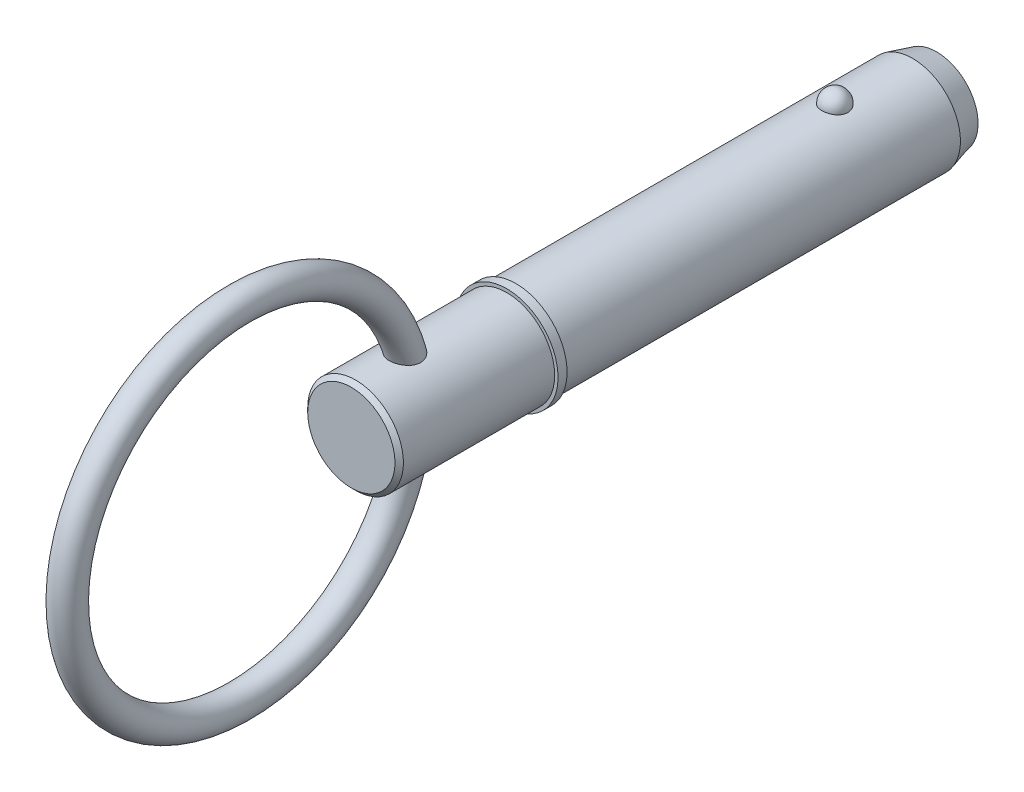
ISO-10303-21;
HEADER;
FILE_DESCRIPTION(('STEP AP214'),'2;1');
FILE_NAME('part.step','',(''),(''),'','','');
FILE_SCHEMA(('AUTOMOTIVE_DESIGN { 1 0 10303 214 1 1 1 1 }'));
ENDSEC;
DATA;
#1=APPLICATION_CONTEXT('core data for automotive mechanical design processes');
#2=APPLICATION_PROTOCOL_DEFINITION('international standard','automotive_design',2000,#1);
#3=PRODUCT_CONTEXT('',#1,'mechanical');
#4=PRODUCT('Part','Part','',(#3));
#5=PRODUCT_RELATED_PRODUCT_CATEGORY('part','',(#4));
#6=PRODUCT_DEFINITION_FORMATION('','',#4);
#7=PRODUCT_DEFINITION_CONTEXT('part definition',#1,'design');
#8=PRODUCT_DEFINITION('design','',#6,#7);
#9=PRODUCT_DEFINITION_SHAPE('','',#8);
#10=(LENGTH_UNIT() NAMED_UNIT(*) SI_UNIT(.MILLI.,.METRE.));
#11=(NAMED_UNIT(*) PLANE_ANGLE_UNIT() SI_UNIT($,.RADIAN.));
#12=(NAMED_UNIT(*) SI_UNIT($,.STERADIAN.) SOLID_ANGLE_UNIT());
#13=UNCERTAINTY_MEASURE_WITH_UNIT(LENGTH_MEASURE(1.E-05),#10,'distance_accuracy_value','');
#14=(GEOMETRIC_REPRESENTATION_CONTEXT(3) GLOBAL_UNCERTAINTY_ASSIGNED_CONTEXT((#13)) GLOBAL_UNIT_ASSIGNED_CONTEXT((#10,
#11,#12)) REPRESENTATION_CONTEXT('',''));
#15=CARTESIAN_POINT('',(0.,0.,0.));
#16=DIRECTION('',(0.,0.,1.));
#17=DIRECTION('',(1.,0.,0.));
#18=AXIS2_PLACEMENT_3D('',#15,#16,#17);
#19=CARTESIAN_POINT('',(0.,0.,50.8));
#20=DIRECTION('',(0.,0.,-1.));
#21=DIRECTION('',(-1.,0.,0.));
#22=AXIS2_PLACEMENT_3D('',#19,#20,#21);
#23=CYLINDRICAL_SURFACE('',#22,7.94);
#24=CARTESIAN_POINT('',(2.13020349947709,7.64891057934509,-2.15));
#25=CARTESIAN_POINT('',(2.1302012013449,7.64891247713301,-2.02978166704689));
#26=CARTESIAN_POINT('',(2.12037546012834,7.65166842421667,-1.90953383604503));
#27=CARTESIAN_POINT('',(2.08130792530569,7.66238579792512,-1.67243962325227));
#28=CARTESIAN_POINT('',(2.05205785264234,7.67034944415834,-1.55559471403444));
#29=CARTESIAN_POINT('',(1.97489181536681,7.69057749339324,-1.32869361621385));
#30=CARTESIAN_POINT('',(1.92698409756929,7.70283999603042,-1.21863445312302));
#31=CARTESIAN_POINT('',(1.81370645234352,7.73029430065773,-1.00831338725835));
#32=CARTESIAN_POINT('',(1.74833715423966,7.7454859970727,-0.908051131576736));
#33=CARTESIAN_POINT('',(1.60144242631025,7.77718699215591,-0.719628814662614));
#34=CARTESIAN_POINT('',(1.51984382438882,7.7937020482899,-0.631526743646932));
#35=CARTESIAN_POINT('',(1.34279837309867,7.82614685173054,-0.470411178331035));
#36=CARTESIAN_POINT('',(1.24735148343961,7.84207659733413,-0.397397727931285));
#37=CARTESIAN_POINT('',(1.04544839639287,7.87153116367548,-0.26868118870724));
#38=CARTESIAN_POINT('',(0.939022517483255,7.88506234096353,-0.212932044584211));
#39=CARTESIAN_POINT('',(0.717931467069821,7.90825597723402,-0.120080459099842));
#40=CARTESIAN_POINT('',(0.603267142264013,7.9179188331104,-0.0829761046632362));
#41=CARTESIAN_POINT('',(0.371015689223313,7.93216561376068,-0.0289596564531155));
#42=CARTESIAN_POINT('',(0.253510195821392,7.93683225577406,-0.0117183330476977));
#43=CARTESIAN_POINT('',(0.0171784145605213,7.94086051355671,0.0031892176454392));
#44=CARTESIAN_POINT('',(-0.101647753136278,7.94022260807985,0.00085721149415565));
#45=CARTESIAN_POINT('',(-0.335567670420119,7.93375751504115,-0.023146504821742));
#46=CARTESIAN_POINT('',(-0.450690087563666,7.92799987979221,-0.0445590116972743));
#47=CARTESIAN_POINT('',(-0.675610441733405,7.91200792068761,-0.105760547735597));
#48=CARTESIAN_POINT('',(-0.785408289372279,7.90177352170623,-0.145549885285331));
#49=CARTESIAN_POINT('',(-0.9972706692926,7.87784802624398,-0.242675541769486));
#50=CARTESIAN_POINT('',(-1.0992893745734,7.86413823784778,-0.300107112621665));
#51=CARTESIAN_POINT('',(-1.29223659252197,7.83474718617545,-0.430887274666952));
#52=CARTESIAN_POINT('',(-1.38316404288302,7.81906573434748,-0.504237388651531));
#53=CARTESIAN_POINT('',(-1.55313516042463,7.78710451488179,-0.666358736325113));
#54=CARTESIAN_POINT('',(-1.63193689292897,7.77081906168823,-0.75538257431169));
#55=CARTESIAN_POINT('',(-1.77366356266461,7.73970270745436,-0.945507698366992));
#56=CARTESIAN_POINT('',(-1.83658745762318,7.72487190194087,-1.04660977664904));
#57=CARTESIAN_POINT('',(-1.94556640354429,7.6981535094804,-1.25927689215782));
#58=CARTESIAN_POINT('',(-1.99143480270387,7.6862989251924,-1.3709418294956));
#59=CARTESIAN_POINT('',(-2.06418311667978,7.66708387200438,-1.60066153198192));
#60=CARTESIAN_POINT('',(-2.0910635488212,7.65972328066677,-1.71871612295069));
#61=CARTESIAN_POINT('',(-2.12508507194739,7.65035479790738,-1.9573607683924));
#62=CARTESIAN_POINT('',(-2.13230490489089,7.64832555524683,-2.0779387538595));
#63=CARTESIAN_POINT('',(-2.12704767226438,7.64978921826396,-2.31862835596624));
#64=CARTESIAN_POINT('',(-2.1145710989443,7.6532819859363,-2.43873998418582));
#65=CARTESIAN_POINT('',(-2.07034166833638,7.66536368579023,-2.67451689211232));
#66=CARTESIAN_POINT('',(-2.03867758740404,7.67392914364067,-2.79020005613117));
#67=CARTESIAN_POINT('',(-1.95694065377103,7.69517736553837,-3.01446692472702));
#68=CARTESIAN_POINT('',(-1.90686710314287,7.70786028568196,-3.12305035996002));
#69=CARTESIAN_POINT('',(-1.78925555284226,7.73600831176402,-3.3306597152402));
#70=CARTESIAN_POINT('',(-1.72162904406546,7.75148739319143,-3.4296336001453));
#71=CARTESIAN_POINT('',(-1.57074739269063,7.78346215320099,-3.61466914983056));
#72=CARTESIAN_POINT('',(-1.48749169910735,7.79995786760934,-3.70073035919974));
#73=CARTESIAN_POINT('',(-1.30720250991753,7.83219119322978,-3.85783594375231));
#74=CARTESIAN_POINT('',(-1.2101234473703,7.84792605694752,-3.92882863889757));
#75=CARTESIAN_POINT('',(-1.00503150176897,7.87681523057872,-4.05342383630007));
#76=CARTESIAN_POINT('',(-0.897019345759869,7.88996971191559,-4.10702749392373));
#77=CARTESIAN_POINT('',(-0.674439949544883,7.91208451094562,-4.19477736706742));
#78=CARTESIAN_POINT('',(-0.55996501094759,7.92109245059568,-4.22914554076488));
#79=CARTESIAN_POINT('',(-0.326625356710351,7.93413878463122,-4.27838865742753));
#80=CARTESIAN_POINT('',(-0.20776113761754,7.93817773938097,-4.29326579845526));
#81=CARTESIAN_POINT('',(0.0287357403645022,7.94081322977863,-4.3030062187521));
#82=CARTESIAN_POINT('',(0.14635312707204,7.93950453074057,-4.29821797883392));
#83=CARTESIAN_POINT('',(0.379062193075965,7.93180098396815,-4.26955229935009));
#84=CARTESIAN_POINT('',(0.494153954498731,7.92540630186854,-4.24567548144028));
#85=CARTESIAN_POINT('',(0.718185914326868,7.90824874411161,-4.17962260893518));
#86=CARTESIAN_POINT('',(0.827145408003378,7.89750055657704,-4.13750805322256));
#87=CARTESIAN_POINT('',(1.03638036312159,7.87277755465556,-4.03615078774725));
#88=CARTESIAN_POINT('',(1.13665531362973,7.85880255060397,-3.97690707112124));
#89=CARTESIAN_POINT('',(1.32729731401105,7.82887859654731,-3.84189297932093));
#90=CARTESIAN_POINT('',(1.41749828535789,7.81290379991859,-3.76589388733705));
#91=CARTESIAN_POINT('',(1.58397257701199,7.78086330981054,-3.59992466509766));
#92=CARTESIAN_POINT('',(1.66024342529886,7.76479760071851,-3.50995206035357));
#93=CARTESIAN_POINT('',(1.79805631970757,7.73405928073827,-3.31688321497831));
#94=CARTESIAN_POINT('',(1.85933944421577,7.719413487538,-3.213597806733));
#95=CARTESIAN_POINT('',(1.96397499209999,7.69345992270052,-2.99796163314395));
#96=CARTESIAN_POINT('',(2.00733488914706,7.68215076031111,-2.88561466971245));
#97=CARTESIAN_POINT('',(2.07068045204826,7.66529896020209,-2.6699413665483));
#98=CARTESIAN_POINT('',(2.09296296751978,7.65919990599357,-2.56732606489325));
#99=CARTESIAN_POINT('',(2.12272535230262,7.65100492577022,-2.35981463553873));
#100=CARTESIAN_POINT('',(2.13020550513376,7.64890892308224,-2.25491855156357));
#101=CARTESIAN_POINT('',(2.13020349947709,7.64891057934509,-2.15));
#102=B_SPLINE_CURVE_WITH_KNOTS('',3,(#24,#25,#26,#27,#28,#29,#30,#31,#32,#33,#34,#35,#36,#37,
#38,#39,#40,#41,#42,#43,#44,#45,#46,#47,#48,#49,#50,#51,#52,#53,#54,#55,#56,#57,#58,#59,#60,#61,
#62,#63,#64,#65,#66,#67,#68,#69,#70,#71,#72,#73,#74,#75,#76,#77,#78,#79,#80,#81,#82,#83,#84,#85,
#86,#87,#88,#89,#90,#91,#92,#93,#94,#95,#96,#97,#98,#99,#100,#101),.UNSPECIFIED.,.T.,.F.,(4,2,2,
2,2,2,2,2,2,2,2,2,2,2,2,2,2,2,2,2,2,2,2,2,2,2,2,2,2,2,2,2,2,2,2,2,2,2,4),(0.,0.360277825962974,
0.720709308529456,1.0809816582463,1.44124102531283,1.80316307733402,2.16508618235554,
2.52603531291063,2.88694740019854,3.24178717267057,3.59659491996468,3.94665496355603,
4.29672088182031,4.64871108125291,5.0007349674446,5.3590619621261,5.71741247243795,
6.079576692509,6.44173104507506,6.80243279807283,7.16312553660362,7.52216203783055,
7.88121215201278,8.24210915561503,8.60301888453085,8.96514709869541,9.32725124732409,
9.68508606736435,10.0428805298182,10.3943622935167,10.7458326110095,11.0961268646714,
11.4464417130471,11.8018724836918,12.1573662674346,12.5186252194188,12.8797333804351,
13.1941658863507,13.5085923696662),.UNSPECIFIED.);
#103=CARTESIAN_POINT('',(2.13020349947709,7.64891057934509,-2.15));
#104=VERTEX_POINT('',#103);
#105=EDGE_CURVE('E101',#104,#104,#102,.T.);
#106=ORIENTED_EDGE('',*,*,#105,.T.);
#107=EDGE_LOOP('',(#106));
#108=FACE_BOUND('',#107,.T.);
#109=CARTESIAN_POINT('',(0.,0.,-15.05));
#110=DIRECTION('',(0.,0.,-1.));
#111=DIRECTION('',(-1.,0.,0.));
#112=AXIS2_PLACEMENT_3D('',#109,#110,#111);
#113=CIRCLE('',#112,7.94);
#114=CARTESIAN_POINT('',(-7.94,0.,-15.05));
#115=VERTEX_POINT('',#114);
#116=EDGE_CURVE('E109',#115,#115,#113,.F.);
#117=ORIENTED_EDGE('',*,*,#116,.T.);
#118=EDGE_LOOP('',(#117));
#119=FACE_BOUND('',#118,.T.);
#120=CARTESIAN_POINT('',(0.,0.,50.8));
#121=DIRECTION('',(0.,0.,1.));
#122=DIRECTION('',(1.,0.,0.));
#123=AXIS2_PLACEMENT_3D('',#120,#121,#122);
#124=CIRCLE('',#123,7.94);
#125=CARTESIAN_POINT('',(7.94,0.,50.8));
#126=VERTEX_POINT('',#125);
#127=EDGE_CURVE('E107',#126,#126,#124,.T.);
#128=ORIENTED_EDGE('',*,*,#127,.F.);
#129=EDGE_LOOP('',(#128));
#130=FACE_BOUND('',#129,.T.);
#131=ADVANCED_FACE('F39',(#108,#119,#130),#23,.T.);
#132=CARTESIAN_POINT('',(0.,0.,-19.05));
#133=DIRECTION('',(0.,0.,-1.));
#134=DIRECTION('',(-1.,0.,0.));
#135=AXIS2_PLACEMENT_3D('',#132,#133,#134);
#136=PLANE('',#135);
#137=CARTESIAN_POINT('',(0.,0.,-19.05));
#138=DIRECTION('',(0.,0.,-1.));
#139=DIRECTION('',(-1.,0.,0.));
#140=AXIS2_PLACEMENT_3D('',#137,#138,#139);
#141=CIRCLE('',#140,6.86820323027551);
#142=CARTESIAN_POINT('',(-6.86820323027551,0.,-19.05));
#143=VERTEX_POINT('',#142);
#144=EDGE_CURVE('E142',#143,#143,#141,.T.);
#145=ORIENTED_EDGE('',*,*,#144,.T.);
#146=EDGE_LOOP('',(#145));
#147=FACE_BOUND('',#146,.T.);
#148=ADVANCED_FACE('F87',(#147),#136,.T.);
#149=CARTESIAN_POINT('',(0.,0.,-19.05));
#150=DIRECTION('',(0.,0.,1.));
#151=DIRECTION('',(1.,0.,0.));
#152=AXIS2_PLACEMENT_3D('',#149,#150,#151);
#153=CONICAL_SURFACE('',#152,6.86820323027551,0.261799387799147);
#154=ORIENTED_EDGE('',*,*,#116,.F.);
#155=EDGE_LOOP('',(#154));
#156=FACE_BOUND('',#155,.T.);
#157=ORIENTED_EDGE('',*,*,#144,.F.);
#158=EDGE_LOOP('',(#157));
#159=FACE_BOUND('',#158,.T.);
#160=ADVANCED_FACE('F93',(#156,#159),#153,.T.);
#161=CARTESIAN_POINT('',(0.,7.94,-2.15));
#162=DIRECTION('',(0.,1.,0.));
#163=DIRECTION('',(0.,0.,1.));
#164=AXIS2_PLACEMENT_3D('',#161,#162,#163);
#165=SPHERICAL_SURFACE('',#164,2.15);
#166=ORIENTED_EDGE('',*,*,#105,.F.);
#167=EDGE_LOOP('',(#166));
#168=FACE_BOUND('',#167,.T.);
#169=ADVANCED_FACE('F112',(#168),#165,.T.);
#170=CARTESIAN_POINT('',(0.,0.,50.8));
#171=DIRECTION('',(0.,0.,-1.));
#172=DIRECTION('',(-1.,0.,0.));
#173=AXIS2_PLACEMENT_3D('',#170,#171,#172);
#174=PLANE('',#173);
#175=ORIENTED_EDGE('',*,*,#127,.T.);
#176=EDGE_LOOP('',(#175));
#177=FACE_BOUND('',#176,.T.);
#178=CARTESIAN_POINT('',(0.,0.,50.8));
#179=DIRECTION('',(0.,0.,-1.));
#180=DIRECTION('',(-1.,0.,0.));
#181=AXIS2_PLACEMENT_3D('',#178,#179,#180);
#182=CIRCLE('',#181,8.5);
#183=CARTESIAN_POINT('',(-8.5,0.,50.8));
#184=VERTEX_POINT('',#183);
#185=EDGE_CURVE('E108',#184,#184,#182,.T.);
#186=ORIENTED_EDGE('',*,*,#185,.T.);
#187=EDGE_LOOP('',(#186));
#188=FACE_BOUND('',#187,.T.);
#189=ADVANCED_FACE('F116',(#177,#188),#174,.T.);
#190=CARTESIAN_POINT('',(0.,0.,33.7287874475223));
#191=DIRECTION('',(0.,0.,-1.));
#192=DIRECTION('',(-1.,0.,0.));
#193=AXIS2_PLACEMENT_3D('',#190,#191,#192);
#194=CYLINDRICAL_SURFACE('',#193,8.5);
#195=CARTESIAN_POINT('',(0.,0.,52.3));
#196=DIRECTION('',(0.,0.,-1.));
#197=DIRECTION('',(-1.,0.,0.));
#198=AXIS2_PLACEMENT_3D('',#195,#196,#197);
#199=CIRCLE('',#198,8.5);
#200=CARTESIAN_POINT('',(-8.5,0.,52.3));
#201=VERTEX_POINT('',#200);
#202=EDGE_CURVE('E133',#201,#201,#199,.T.);
#203=ORIENTED_EDGE('',*,*,#202,.T.);
#204=EDGE_LOOP('',(#203));
#205=FACE_BOUND('',#204,.T.);
#206=ORIENTED_EDGE('',*,*,#185,.F.);
#207=EDGE_LOOP('',(#206));
#208=FACE_BOUND('',#207,.T.);
#209=ADVANCED_FACE('F120',(#205,#208),#194,.T.);
#210=CARTESIAN_POINT('',(0.,8.5,52.3));
#211=DIRECTION('',(0.,0.,1.));
#212=DIRECTION('',(1.,0.,0.));
#213=AXIS2_PLACEMENT_3D('',#210,#211,#212);
#214=PLANE('',#213);
#215=CARTESIAN_POINT('',(0.,0.,52.3));
#216=DIRECTION('',(0.,0.,1.));
#217=DIRECTION('',(1.,0.,0.));
#218=AXIS2_PLACEMENT_3D('',#215,#216,#217);
#219=CIRCLE('',#218,7.94);
#220=CARTESIAN_POINT('',(7.94,0.,52.3));
#221=VERTEX_POINT('',#220);
#222=EDGE_CURVE('E111',#221,#221,#219,.T.);
#223=ORIENTED_EDGE('',*,*,#222,.F.);
#224=EDGE_LOOP('',(#223));
#225=FACE_BOUND('',#224,.T.);
#226=ORIENTED_EDGE('',*,*,#202,.F.);
#227=EDGE_LOOP('',(#226));
#228=FACE_BOUND('',#227,.T.);
#229=ADVANCED_FACE('F84',(#225,#228),#214,.T.);
#230=CARTESIAN_POINT('',(0.,0.,78.11));
#231=DIRECTION('',(0.,0.,-1.));
#232=DIRECTION('',(-1.,0.,0.));
#233=AXIS2_PLACEMENT_3D('',#230,#231,#232);
#234=CYLINDRICAL_SURFACE('',#233,7.94);
#235=CARTESIAN_POINT('',(-1.15544091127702,-7.85547938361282,66.911910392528));
#236=CARTESIAN_POINT('',(-1.03089695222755,-7.87379554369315,66.8496153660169));
#237=CARTESIAN_POINT('',(-0.900845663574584,-7.8898743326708,66.7975936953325));
#238=CARTESIAN_POINT('',(-0.633417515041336,-7.91583465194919,66.715265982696));
#239=CARTESIAN_POINT('',(-0.496037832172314,-7.92571377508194,66.6849683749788));
#240=CARTESIAN_POINT('',(-0.217881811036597,-7.93823020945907,66.6467734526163));
#241=CARTESIAN_POINT('',(-0.0771057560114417,-7.94086812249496,66.6388742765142));
#242=CARTESIAN_POINT('',(0.203828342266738,-7.93862624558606,66.6456489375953));
#243=CARTESIAN_POINT('',(0.343986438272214,-7.93374711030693,66.6603208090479));
#244=CARTESIAN_POINT('',(0.619544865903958,-7.9169944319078,66.7118776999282));
#245=CARTESIAN_POINT('',(0.754950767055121,-7.9051293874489,66.748735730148));
#246=CARTESIAN_POINT('',(1.01737529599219,-7.8756583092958,66.8438425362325));
#247=CARTESIAN_POINT('',(1.14439334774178,-7.85805188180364,66.9020927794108));
#248=CARTESIAN_POINT('',(1.38668443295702,-7.81893907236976,67.0388428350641));
#249=CARTESIAN_POINT('',(1.50193494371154,-7.79742542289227,67.1173804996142));
#250=CARTESIAN_POINT('',(1.71711272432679,-7.75288428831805,67.2928724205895));
#251=CARTESIAN_POINT('',(1.81704089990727,-7.72985689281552,67.3898255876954));
#252=CARTESIAN_POINT('',(1.99787261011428,-7.68509802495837,67.5988714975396));
#253=CARTESIAN_POINT('',(2.07893183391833,-7.66335713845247,67.7108273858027));
#254=CARTESIAN_POINT('',(2.22076589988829,-7.62346723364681,67.9474809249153));
#255=CARTESIAN_POINT('',(2.28154607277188,-7.6053172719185,68.0721752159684));
#256=CARTESIAN_POINT('',(2.38011540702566,-7.57504217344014,68.3276189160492));
#257=CARTESIAN_POINT('',(2.41840843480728,-7.56278621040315,68.4581588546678));
#258=CARTESIAN_POINT('',(2.47363993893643,-7.54490265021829,68.7240951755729));
#259=CARTESIAN_POINT('',(2.49057788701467,-7.53927521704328,68.8594916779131));
#260=CARTESIAN_POINT('',(2.50351014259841,-7.53499042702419,69.1324287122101));
#261=CARTESIAN_POINT('',(2.49933630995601,-7.53638902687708,69.2699777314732));
#262=CARTESIAN_POINT('',(2.47072547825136,-7.54581524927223,69.5426982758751));
#263=CARTESIAN_POINT('',(2.44628184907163,-7.55384504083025,69.6778690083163));
#264=CARTESIAN_POINT('',(2.3758931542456,-7.57629160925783,69.9530857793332));
#265=CARTESIAN_POINT('',(2.32844094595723,-7.5911515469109,70.0927089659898));
#266=CARTESIAN_POINT('',(2.21332780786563,-7.62550828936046,70.3627818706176));
#267=CARTESIAN_POINT('',(2.14565489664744,-7.64500784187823,70.4932260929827));
#268=CARTESIAN_POINT('',(1.98438755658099,-7.68852412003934,70.7537020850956));
#269=CARTESIAN_POINT('',(1.88896913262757,-7.71279219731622,70.8825698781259));
#270=CARTESIAN_POINT('',(1.67743245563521,-7.76154719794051,71.122112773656));
#271=CARTESIAN_POINT('',(1.56130644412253,-7.78603420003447,71.2327810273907));
#272=CARTESIAN_POINT('',(1.31168281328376,-7.83191501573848,71.4301000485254));
#273=CARTESIAN_POINT('',(1.17841631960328,-7.85334315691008,71.5170293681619));
#274=CARTESIAN_POINT('',(0.967442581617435,-7.88116219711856,71.6266577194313));
#275=CARTESIAN_POINT('',(0.895283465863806,-7.88971376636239,71.6597363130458));
#276=CARTESIAN_POINT('',(0.74777743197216,-7.90505596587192,71.7184005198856));
#277=CARTESIAN_POINT('',(0.672431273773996,-7.91184701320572,71.7439879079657));
#278=CARTESIAN_POINT('',(0.530575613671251,-7.92252382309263,71.7839121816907));
#279=CARTESIAN_POINT('',(0.46439476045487,-7.92668987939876,71.799349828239));
#280=CARTESIAN_POINT('',(0.330815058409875,-7.9333870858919,71.8240698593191));
#281=CARTESIAN_POINT('',(0.263416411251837,-7.93591850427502,71.8333532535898));
#282=CARTESIAN_POINT('',(0.128041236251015,-7.93925585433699,71.8455779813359));
#283=CARTESIAN_POINT('',(0.0600650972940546,-7.94006286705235,71.8485232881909));
#284=CARTESIAN_POINT('',(-0.0758408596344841,-7.93992929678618,71.8480336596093));
#285=CARTESIAN_POINT('',(-0.143770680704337,-7.93898884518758,71.8445992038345));
#286=CARTESIAN_POINT('',(-0.330023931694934,-7.93402174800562,71.8264060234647));
#287=CARTESIAN_POINT('',(-0.447720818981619,-7.92820264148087,71.8050608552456));
#288=CARTESIAN_POINT('',(-0.677833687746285,-7.91185818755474,71.7440930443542));
#289=CARTESIAN_POINT('',(-0.790248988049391,-7.90133223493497,71.7044680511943));
#290=CARTESIAN_POINT('',(-1.01082100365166,-7.8762011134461,71.6074365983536));
#291=CARTESIAN_POINT('',(-1.1187367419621,-7.86147932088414,71.549515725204));
#292=CARTESIAN_POINT('',(-1.32464461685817,-7.8294189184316,71.4187556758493));
#293=CARTESIAN_POINT('',(-1.42263264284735,-7.81207923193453,71.3459103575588));
#294=CARTESIAN_POINT('',(-1.62038324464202,-7.77363945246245,71.1765366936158));
#295=CARTESIAN_POINT('',(-1.7184938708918,-7.75235190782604,71.0781231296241));
#296=CARTESIAN_POINT('',(-1.89908721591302,-7.71010284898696,70.8677830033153));
#297=CARTESIAN_POINT('',(-1.9815587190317,-7.68914157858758,70.7558468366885));
#298=CARTESIAN_POINT('',(-2.13974270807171,-7.64674394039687,70.5051085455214));
#299=CARTESIAN_POINT('',(-2.21304020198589,-7.62562536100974,70.3647194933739));
#300=CARTESIAN_POINT('',(-2.33615659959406,-7.58881542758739,70.0732666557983));
#301=CARTESIAN_POINT('',(-2.38596943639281,-7.57312547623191,69.9222001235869));
#302=CARTESIAN_POINT('',(-2.46059473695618,-7.54921618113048,69.6104922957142));
#303=CARTESIAN_POINT('',(-2.48494918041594,-7.54113395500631,69.4497288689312));
#304=CARTESIAN_POINT('',(-2.50480773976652,-7.53456588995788,69.1262447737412));
#305=CARTESIAN_POINT('',(-2.50033692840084,-7.53607171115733,68.9635259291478));
#306=CARTESIAN_POINT('',(-2.46306926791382,-7.54832452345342,68.6571659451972));
#307=CARTESIAN_POINT('',(-2.4329569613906,-7.55819528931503,68.5131623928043));
#308=CARTESIAN_POINT('',(-2.34806892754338,-7.58499431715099,68.2333040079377));
#309=CARTESIAN_POINT('',(-2.29330013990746,-7.60192059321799,68.0974468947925));
#310=CARTESIAN_POINT('',(-2.16523724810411,-7.63933506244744,67.8476573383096));
#311=CARTESIAN_POINT('',(-2.09353456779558,-7.65948502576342,67.7328530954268));
#312=CARTESIAN_POINT('',(-1.93200913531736,-7.7018104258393,67.5172680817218));
#313=CARTESIAN_POINT('',(-1.84219262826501,-7.72398516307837,67.4164824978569));
#314=CARTESIAN_POINT('',(-1.65746337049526,-7.76558957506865,67.2413148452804));
#315=CARTESIAN_POINT('',(-1.56413624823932,-7.78505810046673,67.1652591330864));
#316=CARTESIAN_POINT('',(-1.36706423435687,-7.82207051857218,67.0275357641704));
#317=CARTESIAN_POINT('',(-1.26331856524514,-7.83961426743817,66.9658691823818));
#318=CARTESIAN_POINT('',(-1.15544091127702,-7.85547938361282,66.911910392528));
#319=B_SPLINE_CURVE_WITH_KNOTS('',3,(#235,#236,#237,#238,#239,#240,#241,#242,#243,#244,#245,
#246,#247,#248,#249,#250,#251,#252,#253,#254,#255,#256,#257,#258,#259,#260,#261,#262,#263,#264,
#265,#266,#267,#268,#269,#270,#271,#272,#273,#274,#275,#276,#277,#278,#279,#280,#281,#282,#283,
#284,#285,#286,#287,#288,#289,#290,#291,#292,#293,#294,#295,#296,#297,#298,#299,#300,#301,#302,
#303,#304,#305,#306,#307,#308,#309,#310,#311,#312,#313,#314,#315,#316,#317,#318),.UNSPECIFIED.,
.T.,.F.,(4,2,2,2,2,2,2,2,2,2,2,2,2,2,2,2,2,2,2,2,2,2,2,2,2,2,2,2,2,2,2,2,2,2,2,2,2,2,2,2,2,4),
(0.,0.420927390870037,0.842018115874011,1.26307384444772,1.68409290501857,2.10460083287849,
2.52513760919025,2.94646475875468,3.36776699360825,3.7854589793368,4.20304108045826,
4.61086922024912,5.0187074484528,5.42979890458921,5.84102487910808,6.28383316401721,
6.72690434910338,7.21113455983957,7.69554657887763,8.1740030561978,8.41316278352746,
8.65226580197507,8.85622998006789,9.0601606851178,9.2639635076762,9.46775100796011,
9.82521046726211,10.1827159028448,10.5513335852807,10.9201032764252,11.3402098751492,
11.7606166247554,12.2377707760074,12.715048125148,13.2007716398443,13.6860727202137,
14.1260485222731,14.5659005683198,14.9745225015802,15.3830037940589,15.7475760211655,
16.1121754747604),.UNSPECIFIED.);
#320=CARTESIAN_POINT('',(-1.15544091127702,-7.85547938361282,66.911910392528));
#321=VERTEX_POINT('',#320);
#322=EDGE_CURVE('E10',#321,#321,#319,.T.);
#323=ORIENTED_EDGE('',*,*,#322,.F.);
#324=EDGE_LOOP('',(#323));
#325=FACE_BOUND('',#324,.T.);
#326=CARTESIAN_POINT('',(-1.15544091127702,7.85547938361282,66.911910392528));
#327=CARTESIAN_POINT('',(-1.27857961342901,7.83736699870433,66.9735072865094));
#328=CARTESIAN_POINT('',(-1.39638360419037,7.8170599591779,67.0451720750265));
#329=CARTESIAN_POINT('',(-1.61803025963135,7.77421032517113,67.2070825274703));
#330=CARTESIAN_POINT('',(-1.72186951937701,7.7516671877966,67.2973327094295));
#331=CARTESIAN_POINT('',(-1.91269683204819,7.70680387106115,67.4943958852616));
#332=CARTESIAN_POINT('',(-1.99967065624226,7.68448389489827,67.6012227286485));
#333=CARTESIAN_POINT('',(-2.15412555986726,7.64262858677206,67.8286078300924));
#334=CARTESIAN_POINT('',(-2.22161184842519,7.62309251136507,67.9491624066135));
#335=CARTESIAN_POINT('',(-2.3342927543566,7.5893410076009,68.198377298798));
#336=CARTESIAN_POINT('',(-2.37985628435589,7.57503857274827,68.3268591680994));
#337=CARTESIAN_POINT('',(-2.44955571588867,7.55278941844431,68.590011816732));
#338=CARTESIAN_POINT('',(-2.47369226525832,7.54484250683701,68.7246824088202));
#339=CARTESIAN_POINT('',(-2.5005961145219,7.53596831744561,68.9961377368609));
#340=CARTESIAN_POINT('',(-2.50339277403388,7.53503139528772,69.1329193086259));
#341=CARTESIAN_POINT('',(-2.48855779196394,7.53994222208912,69.4052240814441));
#342=CARTESIAN_POINT('',(-2.47092012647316,7.54579197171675,69.5407468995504));
#343=CARTESIAN_POINT('',(-2.41469361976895,7.56397908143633,69.8162931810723));
#344=CARTESIAN_POINT('',(-2.37479606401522,7.57671999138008,69.9560213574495));
#345=CARTESIAN_POINT('',(-2.27489955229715,7.60730881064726,70.2275158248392));
#346=CARTESIAN_POINT('',(-2.21489004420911,7.6251594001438,70.3592778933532));
#347=CARTESIAN_POINT('',(-2.06943931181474,7.66598084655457,70.6245250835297));
#348=CARTESIAN_POINT('',(-1.98208275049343,7.68928197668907,70.7569147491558));
#349=CARTESIAN_POINT('',(-1.78658869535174,7.73704343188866,71.0052357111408));
#350=CARTESIAN_POINT('',(-1.67843905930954,7.76150442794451,71.121157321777));
#351=CARTESIAN_POINT('',(-1.44142605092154,7.80900750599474,71.3336999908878));
#352=CARTESIAN_POINT('',(-1.31231821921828,7.83202775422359,71.4300586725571));
#353=CARTESIAN_POINT('',(-1.10627655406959,7.86286215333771,71.5546145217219));
#354=CARTESIAN_POINT('',(-1.03552563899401,7.87252500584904,71.5928053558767));
#355=CARTESIAN_POINT('',(-0.890375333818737,7.89025728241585,71.6618851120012));
#356=CARTESIAN_POINT('',(-0.815978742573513,7.89832790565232,71.6927795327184));
#357=CARTESIAN_POINT('',(-0.674180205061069,7.91160332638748,71.7430828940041));
#358=CARTESIAN_POINT('',(-0.607145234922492,7.91704543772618,71.763468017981));
#359=CARTESIAN_POINT('',(-0.471385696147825,7.92628663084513,71.7978763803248));
#360=CARTESIAN_POINT('',(-0.402662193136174,7.93008672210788,71.8119035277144));
#361=CARTESIAN_POINT('',(-0.264153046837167,7.9359070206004,71.833322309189));
#362=CARTESIAN_POINT('',(-0.194368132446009,7.9379283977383,71.8407183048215));
#363=CARTESIAN_POINT('',(-0.054405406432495,7.940122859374,71.8487430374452));
#364=CARTESIAN_POINT('',(0.0157723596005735,7.94029615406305,71.8493725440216));
#365=CARTESIAN_POINT('',(0.206295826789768,7.93822912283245,71.8418250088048));
#366=CARTESIAN_POINT('',(0.326425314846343,7.93416340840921,71.8269891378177));
#367=CARTESIAN_POINT('',(0.562310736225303,7.92094769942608,71.7780777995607));
#368=CARTESIAN_POINT('',(0.678066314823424,7.91179729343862,71.74400077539));
#369=CARTESIAN_POINT('',(0.903029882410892,7.88929555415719,71.6582699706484));
#370=CARTESIAN_POINT('',(1.01220356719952,7.87592415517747,71.6065321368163));
#371=CARTESIAN_POINT('',(1.22142047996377,7.84620431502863,71.4877939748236));
#372=CARTESIAN_POINT('',(1.32146048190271,7.82985482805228,71.4207882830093));
#373=CARTESIAN_POINT('',(1.52328754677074,7.7932678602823,71.2643092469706));
#374=CARTESIAN_POINT('',(1.6236508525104,7.77280069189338,71.1730560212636));
#375=CARTESIAN_POINT('',(1.80985117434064,7.73156849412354,70.9768153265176));
#376=CARTESIAN_POINT('',(1.89567824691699,7.71080327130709,70.8718185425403));
#377=CARTESIAN_POINT('',(2.06302404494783,7.66785771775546,70.6345434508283));
#378=CARTESIAN_POINT('',(2.14213178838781,7.64590590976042,70.5005149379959));
#379=CARTESIAN_POINT('',(2.27825755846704,7.60645646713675,70.2209949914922));
#380=CARTESIAN_POINT('',(2.33526577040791,7.58896081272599,70.0754984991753));
#381=CARTESIAN_POINT('',(2.42707573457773,7.56011538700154,69.7702423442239));
#382=CARTESIAN_POINT('',(2.4608459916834,7.54905411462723,69.6101404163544));
#383=CARTESIAN_POINT('',(2.49980168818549,7.53624914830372,69.2861292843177));
#384=CARTESIAN_POINT('',(2.50500938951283,7.5344981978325,69.1222231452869));
#385=CARTESIAN_POINT('',(2.48594104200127,7.54080673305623,68.8099762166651));
#386=CARTESIAN_POINT('',(2.46407777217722,7.54806351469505,68.6614732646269));
#387=CARTESIAN_POINT('',(2.3945479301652,7.57040718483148,68.371258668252));
#388=CARTESIAN_POINT('',(2.34689355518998,7.58549037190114,68.2295438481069));
#389=CARTESIAN_POINT('',(2.23182745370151,7.62009243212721,67.9691410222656));
#390=CARTESIAN_POINT('',(2.166377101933,7.63914093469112,67.8495179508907));
#391=CARTESIAN_POINT('',(2.01638736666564,7.68009146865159,67.6234609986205));
#392=CARTESIAN_POINT('',(1.93184850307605,7.7019934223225,67.5170267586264));
#393=CARTESIAN_POINT('',(1.74664202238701,7.74608439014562,67.3206697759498));
#394=CARTESIAN_POINT('',(1.64607913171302,7.76827073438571,67.2306474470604));
#395=CARTESIAN_POINT('',(1.43119791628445,7.81071401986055,67.0683086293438));
#396=CARTESIAN_POINT('',(1.31687846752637,7.83097080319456,66.9959935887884));
#397=CARTESIAN_POINT('',(1.07477437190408,7.86789551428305,66.8691492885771));
#398=CARTESIAN_POINT('',(0.946739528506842,7.88446964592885,66.8150698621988));
#399=CARTESIAN_POINT('',(0.683029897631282,7.91167708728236,66.7282136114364));
#400=CARTESIAN_POINT('',(0.547354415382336,7.92230985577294,66.6954387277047));
#401=CARTESIAN_POINT('',(0.271066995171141,7.93658630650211,66.651730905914));
#402=CARTESIAN_POINT('',(0.130424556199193,7.94017418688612,66.6409723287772));
#403=CARTESIAN_POINT('',(-0.150736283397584,7.93981282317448,66.6420624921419));
#404=CARTESIAN_POINT('',(-0.291254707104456,7.93586558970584,66.653905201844));
#405=CARTESIAN_POINT('',(-0.556023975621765,7.92151946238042,66.6978917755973));
#406=CARTESIAN_POINT('',(-0.680621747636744,7.91171585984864,66.7281668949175));
#407=CARTESIAN_POINT('',(-0.923476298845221,7.88705844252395,66.8067364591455));
#408=CARTESIAN_POINT('',(-1.04173303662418,7.87220459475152,66.8550310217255));
#409=CARTESIAN_POINT('',(-1.15544091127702,7.85547938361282,66.911910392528));
#410=B_SPLINE_CURVE_WITH_KNOTS('',3,(#326,#327,#328,#329,#330,#331,#332,#333,#334,#335,#336,
#337,#338,#339,#340,#341,#342,#343,#344,#345,#346,#347,#348,#349,#350,#351,#352,#353,#354,#355,
#356,#357,#358,#359,#360,#361,#362,#363,#364,#365,#366,#367,#368,#369,#370,#371,#372,#373,#374,
#375,#376,#377,#378,#379,#380,#381,#382,#383,#384,#385,#386,#387,#388,#389,#390,#391,#392,#393,
#394,#395,#396,#397,#398,#399,#400,#401,#402,#403,#404,#405,#406,#407,#408,#409),.UNSPECIFIED.,
.T.,.F.,(4,2,2,2,2,2,2,2,2,2,2,2,2,2,2,2,2,2,2,2,2,2,2,2,2,2,2,2,2,2,2,2,2,2,2,2,2,2,2,2,2,4),
(0.,0.416167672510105,0.832436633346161,1.24905527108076,1.66556244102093,2.07479168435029,
2.48400855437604,2.89266231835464,3.30143658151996,3.73725068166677,4.17329379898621,
4.65204873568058,5.13108409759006,5.61617224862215,5.85876072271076,6.1011657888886,
6.31168904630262,6.52208269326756,6.73233785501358,6.94256910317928,7.30398888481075,
7.66543791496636,8.02863174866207,8.39195337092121,8.80190673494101,9.21213940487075,
9.68159903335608,10.1512669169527,10.6406305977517,11.1296128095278,11.5779838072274,
12.0261429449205,12.4372146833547,12.8482752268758,13.256751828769,13.6652618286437,
14.0832160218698,14.5012082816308,14.9224982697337,15.3436758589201,15.72796797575,
16.1122626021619),.UNSPECIFIED.);
#411=CARTESIAN_POINT('',(-1.15544091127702,7.85547938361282,66.911910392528));
#412=VERTEX_POINT('',#411);
#413=EDGE_CURVE('E51',#412,#412,#410,.T.);
#414=ORIENTED_EDGE('',*,*,#413,.F.);
#415=EDGE_LOOP('',(#414));
#416=FACE_BOUND('',#415,.T.);
#417=CARTESIAN_POINT('',(0.,0.,77.41));
#418=DIRECTION('',(0.,0.,-1.));
#419=DIRECTION('',(-1.,0.,0.));
#420=AXIS2_PLACEMENT_3D('',#417,#418,#419);
#421=CIRCLE('',#420,7.94);
#422=CARTESIAN_POINT('',(-7.94,0.,77.41));
#423=VERTEX_POINT('',#422);
#424=EDGE_CURVE('E63',#423,#423,#421,.T.);
#425=ORIENTED_EDGE('',*,*,#424,.T.);
#426=EDGE_LOOP('',(#425));
#427=FACE_BOUND('',#426,.T.);
#428=ORIENTED_EDGE('',*,*,#222,.T.);
#429=EDGE_LOOP('',(#428));
#430=FACE_BOUND('',#429,.T.);
#431=ADVANCED_FACE('F68',(#325,#416,#427,#430),#234,.T.);
#432=CARTESIAN_POINT('',(0.,0.,78.11));
#433=DIRECTION('',(0.,0.,-1.));
#434=DIRECTION('',(-1.,0.,0.));
#435=AXIS2_PLACEMENT_3D('',#432,#433,#434);
#436=PLANE('',#435);
#437=CARTESIAN_POINT('',(0.,0.,78.11));
#438=DIRECTION('',(0.,0.,-1.));
#439=DIRECTION('',(-1.,0.,0.));
#440=AXIS2_PLACEMENT_3D('',#437,#438,#439);
#441=CIRCLE('',#440,7.24);
#442=CARTESIAN_POINT('',(-7.24,0.,78.11));
#443=VERTEX_POINT('',#442);
#444=EDGE_CURVE('E57',#443,#443,#441,.F.);
#445=ORIENTED_EDGE('',*,*,#444,.T.);
#446=EDGE_LOOP('',(#445));
#447=FACE_BOUND('',#446,.T.);
#448=ADVANCED_FACE('F75',(#447),#436,.F.);
#449=CARTESIAN_POINT('',(0.,0.,77.41));
#450=DIRECTION('',(0.,0.,-1.));
#451=DIRECTION('',(-1.,0.,0.));
#452=AXIS2_PLACEMENT_3D('',#449,#450,#451);
#453=CONICAL_SURFACE('',#452,7.94,0.785398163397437);
#454=ORIENTED_EDGE('',*,*,#444,.F.);
#455=EDGE_LOOP('',(#454));
#456=FACE_BOUND('',#455,.T.);
#457=ORIENTED_EDGE('',*,*,#424,.F.);
#458=EDGE_LOOP('',(#457));
#459=FACE_BOUND('',#458,.T.);
#460=ADVANCED_FACE('F41',(#456,#459),#453,.T.);
#461=CARTESIAN_POINT('',(0.,0.,96.685));
#462=DIRECTION('',(1.,0.,0.));
#463=DIRECTION('',(0.,0.,-1.));
#464=AXIS2_PLACEMENT_3D('',#461,#462,#463);
#465=TOROIDAL_SURFACE('',#464,28.575,2.5);
#466=ORIENTED_EDGE('',*,*,#322,.T.);
#467=EDGE_LOOP('',(#466));
#468=FACE_BOUND('',#467,.T.);
#469=ORIENTED_EDGE('',*,*,#413,.T.);
#470=EDGE_LOOP('',(#469));
#471=FACE_BOUND('',#470,.T.);
#472=ADVANCED_FACE('F72',(#468,#471),#465,.T.);
#473=CLOSED_SHELL('',(#131,#148,#160,#169,#189,#209,#229,#431,#448,#460,#472));
#474=MANIFOLD_SOLID_BREP('B2',#473);
#475=ADVANCED_BREP_SHAPE_REPRESENTATION('',(#18,#474),#14);
#476=SHAPE_DEFINITION_REPRESENTATION(#9,#475);
ENDSEC;
END-ISO-10303-21;
